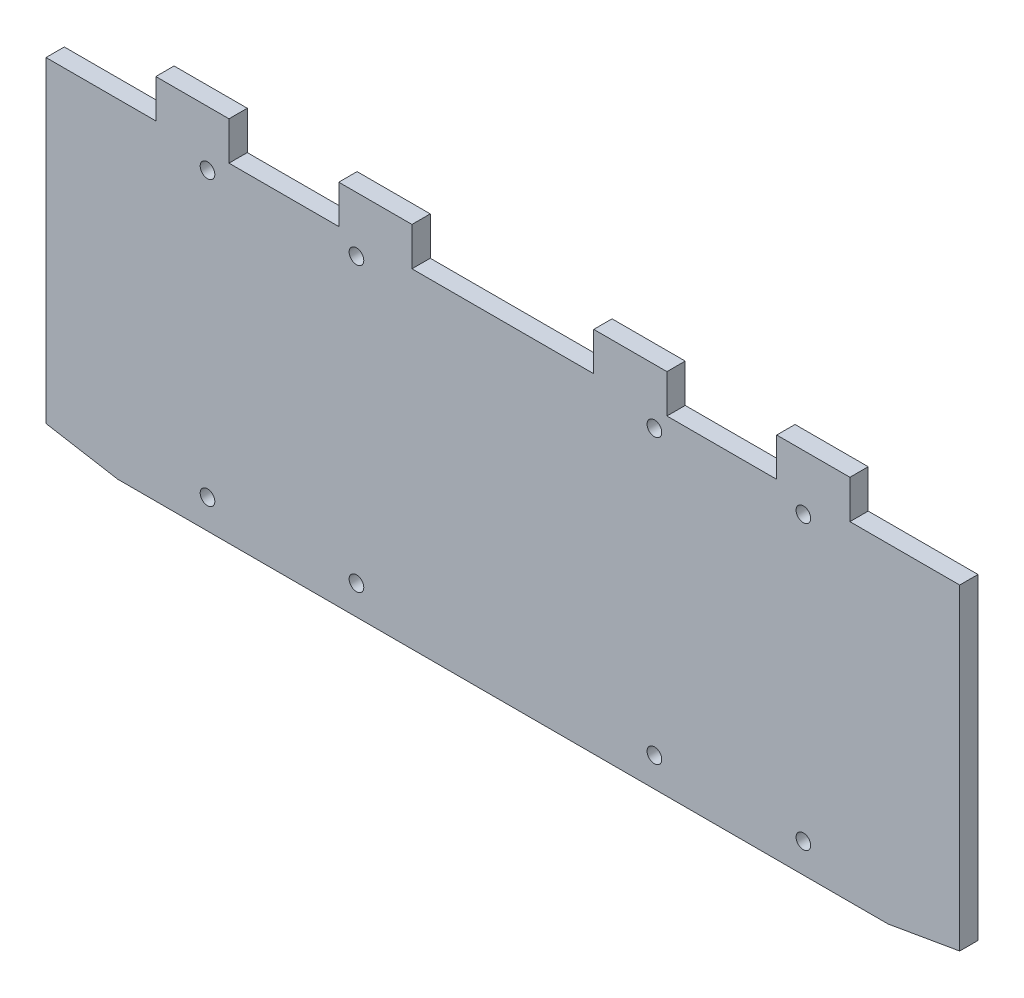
from build123d import *

# Parameters (mm, degrees)
SKETCH1_R           = 1.27
BOSS_EXTRUDE1_DEPTH = 3.175


with BuildPart() as part:
    # Sketch1 → Boss-Extrude1 (new body)
    with BuildSketch(Plane.XY):
        Polygon((1.27, -53.732604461), (-11.157711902, -55.88), (-144.842288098, -55.88), (-157.27, -53.732604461), (-157.27, 1.27), (-138.22, 1.27), (-138.22, 7.9375), (-125.52, 7.9375), (-125.52, 1.27), (-106.47, 1.27), (-106.47, 7.9375), (-93.77, 7.9375), (-93.77, 1.27), (-62.23, 1.27), (-62.23, 7.9375), (-49.53, 7.9375), (-49.53, 1.27), (-30.48, 1.27), (-30.48, 7.9375), (-17.78, 7.9375), (-17.78, 1.27), (1.27, 1.27), align=None)
        with Locations((-129.25, -1.662604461)):
            Circle(SKETCH1_R, mode=Mode.SUBTRACT)
        with Locations((-103.4, -1.662604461)):
            Circle(SKETCH1_R, mode=Mode.SUBTRACT)
        with Locations((-129.25, -50.8)):
            Circle(SKETCH1_R, mode=Mode.SUBTRACT)
        with Locations((-103.4, -50.8)):
            Circle(SKETCH1_R, mode=Mode.SUBTRACT)
        with Locations((-51.7, -50.8)):
            Circle(SKETCH1_R, mode=Mode.SUBTRACT)
        with Locations((-25.85, -50.8)):
            Circle(SKETCH1_R, mode=Mode.SUBTRACT)
        with Locations((-51.7, -1.662604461)):
            Circle(SKETCH1_R, mode=Mode.SUBTRACT)
        with Locations((-25.85, -1.662604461)):
            Circle(SKETCH1_R, mode=Mode.SUBTRACT)
    extrude(amount=BOSS_EXTRUDE1_DEPTH)


solid = part.part
